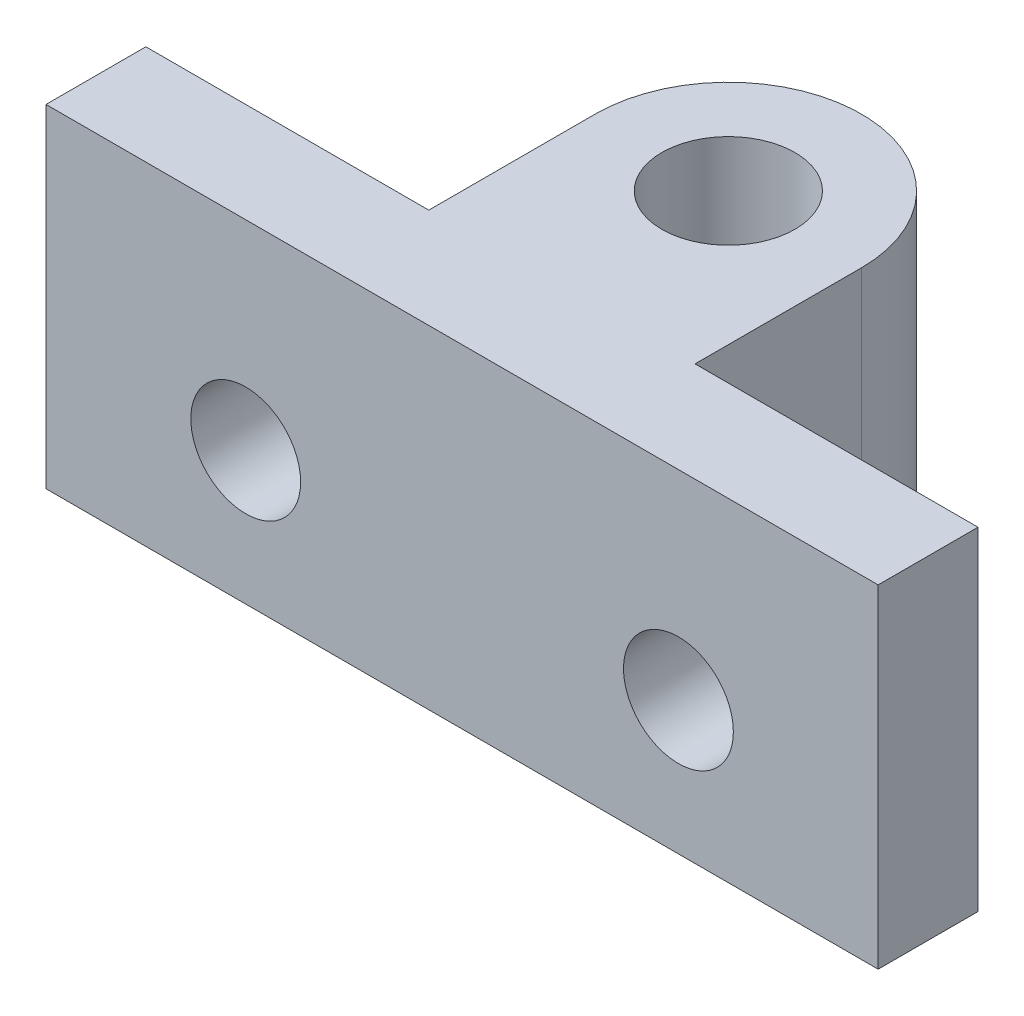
from build123d import *

# Parameters (mm, degrees)
SKETCH_2_R              = 2
EXTRUDE_1_DEPTH         = 10
HOLE_WIZARD_3_3_3_3_1_D = 3.3


with BuildPart() as part:
    # Sketch 2 → Extrude 1 (new body)
    with BuildSketch(Plane(origin=(0, 0, 0), x_dir=(1, 0, 0), z_dir=(0, 1, 0))):
        with BuildLine():
            Line((16.5, 3), (16.5, 8))
            ThreePointArc((16.5, 8), (12.5, 12), (8.5, 8))
            Line((8.5, 8), (8.5, 3))
            Line((8.5, 3), (0, 3))
            Line((0, 3), (0, 0))
            Line((0, 0), (25, 0))
            Line((25, 0), (25, 3))
            Line((25, 3), (16.5, 3))
        make_face()
        with Locations(Location((12.5, 8, 0), (0, 0, 270))):
            Circle(SKETCH_2_R, mode=Mode.SUBTRACT)
    extrude(amount=EXTRUDE_1_DEPTH)

    # Hole Wizard 3.3 _3.3_ _1 (through all)
    with Locations(Plane.XY):
        with Locations((6, 4), (19, 4)):
            Hole(HOLE_WIZARD_3_3_3_3_1_D / 2)


solid = part.part
